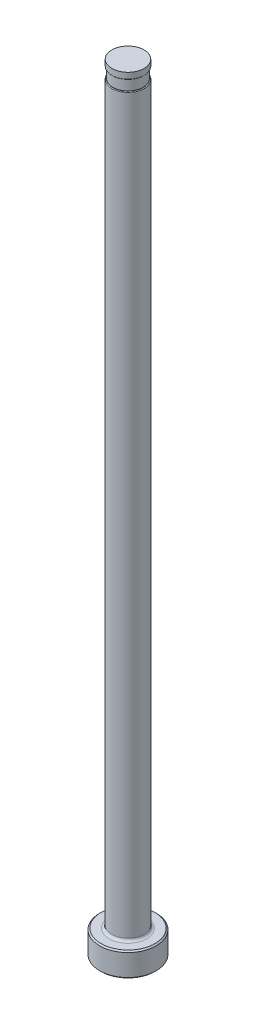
from build123d import *

# Parameters (mm, degrees)
CHAMFER1_SIZE     = 0.254
FILLET1_R         = 0.508
SKETCH2_W         = 0.2032
SKETCH2_H         = 2.032
D_SLOT_DEPTH      = 153.60197502
D_SLOT_DEPTH_BACK = 153.60197502
SKETCH5_W         = 0.0127
SKETCH5_H         = 1.27
FILLET2_R         = 0.127


with BuildPart() as part:
    # Sketch1 → Revolve1 (revolve)
    with BuildSketch(Plane.XY, mode=Mode.PRIVATE) as revolve1_sk:
        Polygon((0, 0), (-5.5499, 0), (-5.5499, 4.7498), (-3.175, 4.7498), (-3.175, 152.4), (0, 152.4), align=None)
    revolve(revolve1_sk.sketch.rotate(Axis((0, 259.958771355, 0), (0, -1, 0)), 270), axis=Axis((0, 259.958771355, 0), (0, -1, 0)))

    # Chamfer1
    chamfer1_edges = [part.edges().sort_by_distance(p)[0] for p in [
        (0, 4.7498, -5.5499),
        (0, 0, -5.5499),
    ]]
    chamfer(chamfer1_edges, length=CHAMFER1_SIZE)

    # Fillet1
    fillet1_edges = [part.edges().sort_by_distance(p)[0] for p in [
        (0, 4.7498, -3.175),
    ]]
    fillet(fillet1_edges, radius=FILLET1_R)

    # Sketch2 → Vent Relief (revolve, cut)
    with BuildSketch(Plane.XY, mode=Mode.PRIVATE) as vent_relief_sk:
        with Locations((-3.0734, 150.114)):
            Rectangle(SKETCH2_W, SKETCH2_H)
    revolve(vent_relief_sk.sketch.rotate(Axis((0, 153.448281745, 0), (0, -1, 0)), 270), axis=Axis((0, 153.448281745, 0), (0, -1, 0)), mode=Mode.SUBTRACT)

    # Sketch3 → D-Slot (cut, two sides: drawn at the far end of the back side and taken through both)
    with BuildSketch(Plane.XY.offset(-D_SLOT_DEPTH_BACK)):
        with BuildLine():
            Line((-2.9718, 150.114), (-2.9718, 86.614))
            ThreePointArc((-2.9718, 86.614), (-3.023013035, 86.046038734), (-3.175, 85.4964))
            Line((-3.175, 85.4964), (-3.175, 150.114))
            Line((-3.175, 150.114), (-2.9718, 150.114))
        make_face()
    extrude(amount=D_SLOT_DEPTH + D_SLOT_DEPTH_BACK, mode=Mode.SUBTRACT)

    # Sketch5 → Vent Diameter (revolve, cut)
    with BuildSketch(Plane.XY, mode=Mode.PRIVATE) as vent_diameter_sk:
        with Locations((-3.16865, 151.765)):
            Rectangle(SKETCH5_W, SKETCH5_H)
    revolve(vent_diameter_sk.sketch.rotate(Axis((0, 152.687735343, 0), (0, -1, 0)), 90), axis=Axis((0, 152.687735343, 0), (0, -1, 0)), mode=Mode.SUBTRACT)

    # Fillet2
    fillet2_edges = [part.edges().sort_by_distance(p)[0] for p in [
        (2.610460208, 149.098, -1.807241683),
        (0, 151.13, 3.1623),
    ]]
    fillet(fillet2_edges, radius=FILLET2_R)


solid = part.part
